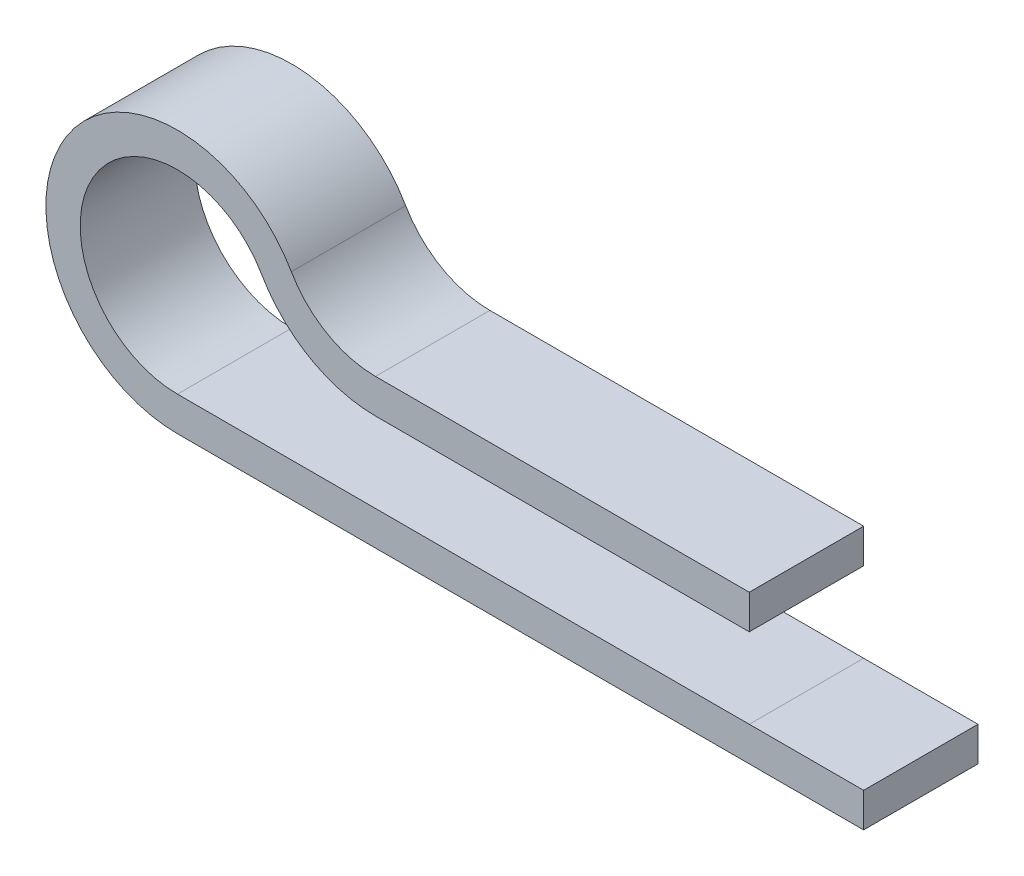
ISO-10303-21;
HEADER;
FILE_DESCRIPTION(('STEP AP214'),'2;1');
FILE_NAME('part.step','',(''),(''),'','','');
FILE_SCHEMA(('AUTOMOTIVE_DESIGN { 1 0 10303 214 1 1 1 1 }'));
ENDSEC;
DATA;
#1=APPLICATION_CONTEXT('core data for automotive mechanical design processes');
#2=APPLICATION_PROTOCOL_DEFINITION('international standard','automotive_design',2000,#1);
#3=PRODUCT_CONTEXT('',#1,'mechanical');
#4=PRODUCT('Part','Part','',(#3));
#5=PRODUCT_RELATED_PRODUCT_CATEGORY('part','',(#4));
#6=PRODUCT_DEFINITION_FORMATION('','',#4);
#7=PRODUCT_DEFINITION_CONTEXT('part definition',#1,'design');
#8=PRODUCT_DEFINITION('design','',#6,#7);
#9=PRODUCT_DEFINITION_SHAPE('','',#8);
#10=(LENGTH_UNIT() NAMED_UNIT(*) SI_UNIT(.MILLI.,.METRE.));
#11=(NAMED_UNIT(*) PLANE_ANGLE_UNIT() SI_UNIT($,.RADIAN.));
#12=(NAMED_UNIT(*) SI_UNIT($,.STERADIAN.) SOLID_ANGLE_UNIT());
#13=UNCERTAINTY_MEASURE_WITH_UNIT(LENGTH_MEASURE(1.E-05),#10,'distance_accuracy_value','');
#14=(GEOMETRIC_REPRESENTATION_CONTEXT(3) GLOBAL_UNCERTAINTY_ASSIGNED_CONTEXT((#13)) GLOBAL_UNIT_ASSIGNED_CONTEXT((#10,
#11,#12)) REPRESENTATION_CONTEXT('',''));
#15=CARTESIAN_POINT('',(0.,0.,0.));
#16=DIRECTION('',(0.,0.,1.));
#17=DIRECTION('',(1.,0.,0.));
#18=AXIS2_PLACEMENT_3D('',#15,#16,#17);
#19=CARTESIAN_POINT('',(0.,0.75,2.5));
#20=DIRECTION('',(0.,1.,0.));
#21=DIRECTION('',(0.,0.,1.));
#22=AXIS2_PLACEMENT_3D('',#19,#20,#21);
#23=PLANE('',#22);
#24=DIRECTION('',(1.,0.,0.));
#25=VECTOR('',#24,1.);
#26=CARTESIAN_POINT('',(0.,0.75,2.5));
#27=LINE('',#26,#25);
#28=CARTESIAN_POINT('',(0.,0.75,2.5));
#29=VERTEX_POINT('',#28);
#30=CARTESIAN_POINT('',(25.,0.75,2.5));
#31=VERTEX_POINT('',#30);
#32=EDGE_CURVE('E154',#29,#31,#27,.T.);
#33=ORIENTED_EDGE('',*,*,#32,.T.);
#34=DIRECTION('',(0.,0.,-1.));
#35=VECTOR('',#34,1.);
#36=CARTESIAN_POINT('',(25.,0.75,2.5));
#37=LINE('',#36,#35);
#38=CARTESIAN_POINT('',(25.,0.75,-2.5));
#39=VERTEX_POINT('',#38);
#40=EDGE_CURVE('E11',#31,#39,#37,.T.);
#41=ORIENTED_EDGE('',*,*,#40,.T.);
#42=DIRECTION('',(1.,0.,0.));
#43=VECTOR('',#42,1.);
#44=CARTESIAN_POINT('',(0.,0.75,-2.5));
#45=LINE('',#44,#43);
#46=CARTESIAN_POINT('',(0.,0.75,-2.5));
#47=VERTEX_POINT('',#46);
#48=EDGE_CURVE('E227',#47,#39,#45,.T.);
#49=ORIENTED_EDGE('',*,*,#48,.F.);
#50=DIRECTION('',(0.,0.,1.));
#51=VECTOR('',#50,1.);
#52=CARTESIAN_POINT('',(0.,0.75,2.5));
#53=LINE('',#52,#51);
#54=EDGE_CURVE('E140',#47,#29,#53,.T.);
#55=ORIENTED_EDGE('',*,*,#54,.T.);
#56=EDGE_LOOP('',(#33,#41,#49,#55));
#57=FACE_BOUND('',#56,.T.);
#58=ADVANCED_FACE('F32',(#57),#23,.T.);
#59=CARTESIAN_POINT('',(0.,-0.750000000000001,2.5));
#60=DIRECTION('',(0.,-1.,0.));
#61=DIRECTION('',(0.,0.,-1.));
#62=AXIS2_PLACEMENT_3D('',#59,#60,#61);
#63=PLANE('',#62);
#64=DIRECTION('',(1.,0.,0.));
#65=VECTOR('',#64,1.);
#66=CARTESIAN_POINT('',(0.,-0.750000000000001,-2.5));
#67=LINE('',#66,#65);
#68=CARTESIAN_POINT('',(0.,-0.750000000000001,-2.5));
#69=VERTEX_POINT('',#68);
#70=CARTESIAN_POINT('',(25.,-0.750000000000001,-2.5));
#71=VERTEX_POINT('',#70);
#72=EDGE_CURVE('E148',#69,#71,#67,.T.);
#73=ORIENTED_EDGE('',*,*,#72,.T.);
#74=DIRECTION('',(0.,0.,1.));
#75=VECTOR('',#74,1.);
#76=CARTESIAN_POINT('',(25.,-0.750000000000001,2.5));
#77=LINE('',#76,#75);
#78=CARTESIAN_POINT('',(25.,-0.750000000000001,2.5));
#79=VERTEX_POINT('',#78);
#80=EDGE_CURVE('E36',#71,#79,#77,.T.);
#81=ORIENTED_EDGE('',*,*,#80,.T.);
#82=DIRECTION('',(1.,0.,0.));
#83=VECTOR('',#82,1.);
#84=CARTESIAN_POINT('',(0.,-0.750000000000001,2.5));
#85=LINE('',#84,#83);
#86=CARTESIAN_POINT('',(0.,-0.750000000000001,2.5));
#87=VERTEX_POINT('',#86);
#88=EDGE_CURVE('E124',#87,#79,#85,.T.);
#89=ORIENTED_EDGE('',*,*,#88,.F.);
#90=DIRECTION('',(0.,0.,-1.));
#91=VECTOR('',#90,1.);
#92=CARTESIAN_POINT('',(0.,-0.750000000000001,2.5));
#93=LINE('',#92,#91);
#94=EDGE_CURVE('E134',#87,#69,#93,.T.);
#95=ORIENTED_EDGE('',*,*,#94,.T.);
#96=EDGE_LOOP('',(#73,#81,#89,#95));
#97=FACE_BOUND('',#96,.T.);
#98=ADVANCED_FACE('F143',(#97),#63,.T.);
#99=CARTESIAN_POINT('',(8.66025403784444,4.25,2.5));
#100=DIRECTION('',(0.,1.,0.));
#101=DIRECTION('',(-1.,0.,0.));
#102=AXIS2_PLACEMENT_3D('',#99,#100,#101);
#103=PLANE('',#102);
#104=DIRECTION('',(0.,0.,1.));
#105=VECTOR('',#104,1.);
#106=CARTESIAN_POINT('',(8.66025403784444,4.25,2.5));
#107=LINE('',#106,#105);
#108=CARTESIAN_POINT('',(8.66025403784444,4.25,-2.5));
#109=VERTEX_POINT('',#108);
#110=CARTESIAN_POINT('',(8.66025403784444,4.25,2.5));
#111=VERTEX_POINT('',#110);
#112=EDGE_CURVE('E167',#109,#111,#107,.T.);
#113=ORIENTED_EDGE('',*,*,#112,.F.);
#114=DIRECTION('',(1.,0.,0.));
#115=VECTOR('',#114,1.);
#116=CARTESIAN_POINT('',(8.66025403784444,4.25,-2.5));
#117=LINE('',#116,#115);
#118=CARTESIAN_POINT('',(25.0000000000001,4.25,-2.5));
#119=VERTEX_POINT('',#118);
#120=EDGE_CURVE('E194',#109,#119,#117,.T.);
#121=ORIENTED_EDGE('',*,*,#120,.T.);
#122=DIRECTION('',(0.,0.,1.));
#123=VECTOR('',#122,1.);
#124=CARTESIAN_POINT('',(25.0000000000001,4.25,2.5));
#125=LINE('',#124,#123);
#126=CARTESIAN_POINT('',(25.0000000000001,4.25,2.5));
#127=VERTEX_POINT('',#126);
#128=EDGE_CURVE('E186',#119,#127,#125,.T.);
#129=ORIENTED_EDGE('',*,*,#128,.T.);
#130=DIRECTION('',(1.,0.,0.));
#131=VECTOR('',#130,1.);
#132=CARTESIAN_POINT('',(8.66025403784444,4.25,2.5));
#133=LINE('',#132,#131);
#134=EDGE_CURVE('E197',#111,#127,#133,.T.);
#135=ORIENTED_EDGE('',*,*,#134,.F.);
#136=EDGE_LOOP('',(#113,#121,#129,#135));
#137=FACE_BOUND('',#136,.T.);
#138=ADVANCED_FACE('F34',(#137),#103,.F.);
#139=CARTESIAN_POINT('',(8.66025403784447,5.75,2.5));
#140=DIRECTION('',(0.,-1.,0.));
#141=DIRECTION('',(1.,0.,0.));
#142=AXIS2_PLACEMENT_3D('',#139,#140,#141);
#143=PLANE('',#142);
#144=DIRECTION('',(0.,0.,-1.));
#145=VECTOR('',#144,1.);
#146=CARTESIAN_POINT('',(8.66025403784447,5.75,2.5));
#147=LINE('',#146,#145);
#148=CARTESIAN_POINT('',(8.66025403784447,5.75,2.5));
#149=VERTEX_POINT('',#148);
#150=CARTESIAN_POINT('',(8.66025403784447,5.75,-2.5));
#151=VERTEX_POINT('',#150);
#152=EDGE_CURVE('E164',#149,#151,#147,.T.);
#153=ORIENTED_EDGE('',*,*,#152,.F.);
#154=DIRECTION('',(1.,0.,0.));
#155=VECTOR('',#154,1.);
#156=CARTESIAN_POINT('',(8.66025403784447,5.75,2.5));
#157=LINE('',#156,#155);
#158=CARTESIAN_POINT('',(25.0000000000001,5.75,2.5));
#159=VERTEX_POINT('',#158);
#160=EDGE_CURVE('E188',#149,#159,#157,.T.);
#161=ORIENTED_EDGE('',*,*,#160,.T.);
#162=DIRECTION('',(0.,0.,-1.));
#163=VECTOR('',#162,1.);
#164=CARTESIAN_POINT('',(25.0000000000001,5.75,2.5));
#165=LINE('',#164,#163);
#166=CARTESIAN_POINT('',(25.0000000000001,5.75,-2.5));
#167=VERTEX_POINT('',#166);
#168=EDGE_CURVE('E182',#159,#167,#165,.T.);
#169=ORIENTED_EDGE('',*,*,#168,.T.);
#170=DIRECTION('',(1.,0.,0.));
#171=VECTOR('',#170,1.);
#172=CARTESIAN_POINT('',(8.66025403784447,5.75,-2.5));
#173=LINE('',#172,#171);
#174=EDGE_CURVE('E191',#151,#167,#173,.T.);
#175=ORIENTED_EDGE('',*,*,#174,.F.);
#176=EDGE_LOOP('',(#153,#161,#169,#175));
#177=FACE_BOUND('',#176,.T.);
#178=ADVANCED_FACE('F222',(#177),#143,.F.);
#179=CARTESIAN_POINT('',(8.66025403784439,10.,0.));
#180=DIRECTION('',(0.,0.,1.));
#181=DIRECTION('',(1.,0.,0.));
#182=AXIS2_PLACEMENT_3D('',#179,#180,#181);
#183=CYLINDRICAL_SURFACE('',#182,5.75);
#184=DIRECTION('',(0.,0.,1.));
#185=VECTOR('',#184,1.);
#186=CARTESIAN_POINT('',(3.68060796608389,7.12499999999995,2.5));
#187=LINE('',#186,#185);
#188=CARTESIAN_POINT('',(3.68060796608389,7.12499999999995,-2.5));
#189=VERTEX_POINT('',#188);
#190=CARTESIAN_POINT('',(3.68060796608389,7.12499999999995,2.5));
#191=VERTEX_POINT('',#190);
#192=EDGE_CURVE('E131',#189,#191,#187,.T.);
#193=ORIENTED_EDGE('',*,*,#192,.F.);
#194=CARTESIAN_POINT('',(8.66025403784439,10.,-2.5));
#195=DIRECTION('',(0.,0.,1.));
#196=DIRECTION('',(1.,0.,0.));
#197=AXIS2_PLACEMENT_3D('',#194,#195,#196);
#198=CIRCLE('',#197,5.75);
#199=EDGE_CURVE('E174',#189,#109,#198,.T.);
#200=ORIENTED_EDGE('',*,*,#199,.T.);
#201=ORIENTED_EDGE('',*,*,#112,.T.);
#202=CARTESIAN_POINT('',(8.66025403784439,10.,2.5));
#203=DIRECTION('',(0.,0.,1.));
#204=DIRECTION('',(1.,0.,0.));
#205=AXIS2_PLACEMENT_3D('',#202,#203,#204);
#206=CIRCLE('',#205,5.75);
#207=EDGE_CURVE('E177',#191,#111,#206,.T.);
#208=ORIENTED_EDGE('',*,*,#207,.F.);
#209=EDGE_LOOP('',(#193,#200,#201,#208));
#210=FACE_BOUND('',#209,.T.);
#211=ADVANCED_FACE('F211',(#210),#183,.T.);
#212=CARTESIAN_POINT('',(8.66025403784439,10.,0.));
#213=DIRECTION('',(0.,0.,1.));
#214=DIRECTION('',(1.,0.,0.));
#215=AXIS2_PLACEMENT_3D('',#212,#213,#214);
#216=CYLINDRICAL_SURFACE('',#215,4.25);
#217=DIRECTION('',(0.,0.,-1.));
#218=VECTOR('',#217,1.);
#219=CARTESIAN_POINT('',(4.97964607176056,7.87499999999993,2.5));
#220=LINE('',#219,#218);
#221=CARTESIAN_POINT('',(4.97964607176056,7.87499999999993,2.5));
#222=VERTEX_POINT('',#221);
#223=CARTESIAN_POINT('',(4.97964607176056,7.87499999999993,-2.5));
#224=VERTEX_POINT('',#223);
#225=EDGE_CURVE('E152',#222,#224,#220,.T.);
#226=ORIENTED_EDGE('',*,*,#225,.F.);
#227=CARTESIAN_POINT('',(8.66025403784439,10.,2.5));
#228=DIRECTION('',(0.,0.,1.));
#229=DIRECTION('',(1.,0.,0.));
#230=AXIS2_PLACEMENT_3D('',#227,#228,#229);
#231=CIRCLE('',#230,4.25);
#232=EDGE_CURVE('E126',#222,#149,#231,.T.);
#233=ORIENTED_EDGE('',*,*,#232,.T.);
#234=ORIENTED_EDGE('',*,*,#152,.T.);
#235=CARTESIAN_POINT('',(8.66025403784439,10.,-2.5));
#236=DIRECTION('',(0.,0.,1.));
#237=DIRECTION('',(1.,0.,0.));
#238=AXIS2_PLACEMENT_3D('',#235,#236,#237);
#239=CIRCLE('',#238,4.25);
#240=EDGE_CURVE('E171',#224,#151,#239,.T.);
#241=ORIENTED_EDGE('',*,*,#240,.F.);
#242=EDGE_LOOP('',(#226,#233,#234,#241));
#243=FACE_BOUND('',#242,.T.);
#244=ADVANCED_FACE('F224',(#243),#216,.F.);
#245=CARTESIAN_POINT('',(0.,5.,0.));
#246=DIRECTION('',(0.,0.,-1.));
#247=DIRECTION('',(-1.,0.,0.));
#248=AXIS2_PLACEMENT_3D('',#245,#246,#247);
#249=CYLINDRICAL_SURFACE('',#248,4.25);
#250=ORIENTED_EDGE('',*,*,#54,.F.);
#251=CARTESIAN_POINT('',(0.,5.,-2.5));
#252=DIRECTION('',(0.,0.,-1.));
#253=DIRECTION('',(-1.,0.,0.));
#254=AXIS2_PLACEMENT_3D('',#251,#252,#253);
#255=CIRCLE('',#254,4.25);
#256=EDGE_CURVE('E158',#47,#189,#255,.T.);
#257=ORIENTED_EDGE('',*,*,#256,.T.);
#258=ORIENTED_EDGE('',*,*,#192,.T.);
#259=CARTESIAN_POINT('',(0.,5.,2.5));
#260=DIRECTION('',(0.,0.,-1.));
#261=DIRECTION('',(-1.,0.,0.));
#262=AXIS2_PLACEMENT_3D('',#259,#260,#261);
#263=CIRCLE('',#262,4.25);
#264=EDGE_CURVE('E161',#29,#191,#263,.T.);
#265=ORIENTED_EDGE('',*,*,#264,.F.);
#266=EDGE_LOOP('',(#250,#257,#258,#265));
#267=FACE_BOUND('',#266,.T.);
#268=ADVANCED_FACE('F245',(#267),#249,.F.);
#269=CARTESIAN_POINT('',(0.,5.,0.));
#270=DIRECTION('',(0.,0.,-1.));
#271=DIRECTION('',(-1.,0.,0.));
#272=AXIS2_PLACEMENT_3D('',#269,#270,#271);
#273=CYLINDRICAL_SURFACE('',#272,5.75);
#274=ORIENTED_EDGE('',*,*,#94,.F.);
#275=CARTESIAN_POINT('',(0.,5.,2.5));
#276=DIRECTION('',(0.,0.,-1.));
#277=DIRECTION('',(-1.,0.,0.));
#278=AXIS2_PLACEMENT_3D('',#275,#276,#277);
#279=CIRCLE('',#278,5.75);
#280=EDGE_CURVE('E119',#87,#222,#279,.T.);
#281=ORIENTED_EDGE('',*,*,#280,.T.);
#282=ORIENTED_EDGE('',*,*,#225,.T.);
#283=CARTESIAN_POINT('',(0.,5.,-2.5));
#284=DIRECTION('',(0.,0.,-1.));
#285=DIRECTION('',(-1.,0.,0.));
#286=AXIS2_PLACEMENT_3D('',#283,#284,#285);
#287=CIRCLE('',#286,5.75);
#288=EDGE_CURVE('E130',#69,#224,#287,.T.);
#289=ORIENTED_EDGE('',*,*,#288,.F.);
#290=EDGE_LOOP('',(#274,#281,#282,#289));
#291=FACE_BOUND('',#290,.T.);
#292=ADVANCED_FACE('F135',(#291),#273,.T.);
#293=CARTESIAN_POINT('',(0.,0.75,2.5));
#294=DIRECTION('',(0.,0.,1.));
#295=DIRECTION('',(0.,-1.,0.));
#296=AXIS2_PLACEMENT_3D('',#293,#294,#295);
#297=PLANE('',#296);
#298=DIRECTION('',(0.,-1.,0.));
#299=VECTOR('',#298,1.);
#300=CARTESIAN_POINT('',(30.,0.75,2.5));
#301=LINE('',#300,#299);
#302=CARTESIAN_POINT('',(30.,0.75,2.5));
#303=VERTEX_POINT('',#302);
#304=CARTESIAN_POINT('',(30.,-0.750000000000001,2.5));
#305=VERTEX_POINT('',#304);
#306=EDGE_CURVE('E239',#303,#305,#301,.T.);
#307=ORIENTED_EDGE('',*,*,#306,.F.);
#308=EDGE_CURVE('E229',#31,#303,#27,.T.);
#309=ORIENTED_EDGE('',*,*,#308,.F.);
#310=ORIENTED_EDGE('',*,*,#32,.F.);
#311=ORIENTED_EDGE('',*,*,#264,.T.);
#312=ORIENTED_EDGE('',*,*,#207,.T.);
#313=ORIENTED_EDGE('',*,*,#134,.T.);
#314=DIRECTION('',(0.,1.,0.));
#315=VECTOR('',#314,1.);
#316=CARTESIAN_POINT('',(25.0000000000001,4.25,2.5));
#317=LINE('',#316,#315);
#318=EDGE_CURVE('E180',#127,#159,#317,.T.);
#319=ORIENTED_EDGE('',*,*,#318,.T.);
#320=ORIENTED_EDGE('',*,*,#160,.F.);
#321=ORIENTED_EDGE('',*,*,#232,.F.);
#322=ORIENTED_EDGE('',*,*,#280,.F.);
#323=ORIENTED_EDGE('',*,*,#88,.T.);
#324=EDGE_CURVE('E146',#79,#305,#85,.T.);
#325=ORIENTED_EDGE('',*,*,#324,.T.);
#326=EDGE_LOOP('',(#307,#309,#310,#311,#312,#313,#319,#320,#321,#322,#323,#325));
#327=FACE_BOUND('',#326,.T.);
#328=ADVANCED_FACE('F122',(#327),#297,.T.);
#329=ORIENTED_EDGE('',*,*,#40,.F.);
#330=ORIENTED_EDGE('',*,*,#308,.T.);
#331=DIRECTION('',(0.,0.,1.));
#332=VECTOR('',#331,1.);
#333=CARTESIAN_POINT('',(30.,0.75,2.5));
#334=LINE('',#333,#332);
#335=CARTESIAN_POINT('',(30.,0.75,-2.5));
#336=VERTEX_POINT('',#335);
#337=EDGE_CURVE('E141',#336,#303,#334,.T.);
#338=ORIENTED_EDGE('',*,*,#337,.F.);
#339=EDGE_CURVE('E226',#39,#336,#45,.T.);
#340=ORIENTED_EDGE('',*,*,#339,.F.);
#341=EDGE_LOOP('',(#329,#330,#338,#340));
#342=FACE_BOUND('',#341,.T.);
#343=ADVANCED_FACE('F247',(#342),#23,.T.);
#344=CARTESIAN_POINT('',(0.,0.75,-2.5));
#345=DIRECTION('',(0.,0.,-1.));
#346=DIRECTION('',(0.,1.,0.));
#347=AXIS2_PLACEMENT_3D('',#344,#345,#346);
#348=PLANE('',#347);
#349=DIRECTION('',(0.,1.,0.));
#350=VECTOR('',#349,1.);
#351=CARTESIAN_POINT('',(30.,0.75,-2.5));
#352=LINE('',#351,#350);
#353=CARTESIAN_POINT('',(30.,-0.750000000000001,-2.5));
#354=VERTEX_POINT('',#353);
#355=EDGE_CURVE('E234',#354,#336,#352,.T.);
#356=ORIENTED_EDGE('',*,*,#355,.F.);
#357=EDGE_CURVE('E145',#71,#354,#67,.T.);
#358=ORIENTED_EDGE('',*,*,#357,.F.);
#359=ORIENTED_EDGE('',*,*,#72,.F.);
#360=ORIENTED_EDGE('',*,*,#288,.T.);
#361=ORIENTED_EDGE('',*,*,#240,.T.);
#362=ORIENTED_EDGE('',*,*,#174,.T.);
#363=DIRECTION('',(0.,-1.,0.));
#364=VECTOR('',#363,1.);
#365=CARTESIAN_POINT('',(25.0000000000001,4.25,-2.5));
#366=LINE('',#365,#364);
#367=EDGE_CURVE('E184',#167,#119,#366,.T.);
#368=ORIENTED_EDGE('',*,*,#367,.T.);
#369=ORIENTED_EDGE('',*,*,#120,.F.);
#370=ORIENTED_EDGE('',*,*,#199,.F.);
#371=ORIENTED_EDGE('',*,*,#256,.F.);
#372=ORIENTED_EDGE('',*,*,#48,.T.);
#373=ORIENTED_EDGE('',*,*,#339,.T.);
#374=EDGE_LOOP('',(#356,#358,#359,#360,#361,#362,#368,#369,#370,#371,#372,#373));
#375=FACE_BOUND('',#374,.T.);
#376=ADVANCED_FACE('F214',(#375),#348,.T.);
#377=ORIENTED_EDGE('',*,*,#80,.F.);
#378=ORIENTED_EDGE('',*,*,#357,.T.);
#379=DIRECTION('',(0.,0.,-1.));
#380=VECTOR('',#379,1.);
#381=CARTESIAN_POINT('',(30.,-0.750000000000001,2.5));
#382=LINE('',#381,#380);
#383=EDGE_CURVE('E236',#305,#354,#382,.T.);
#384=ORIENTED_EDGE('',*,*,#383,.F.);
#385=ORIENTED_EDGE('',*,*,#324,.F.);
#386=EDGE_LOOP('',(#377,#378,#384,#385));
#387=FACE_BOUND('',#386,.T.);
#388=ADVANCED_FACE('F252',(#387),#63,.T.);
#389=CARTESIAN_POINT('',(25.0000000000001,5.75,2.5));
#390=DIRECTION('',(-1.,0.,0.));
#391=DIRECTION('',(0.,0.,-1.));
#392=AXIS2_PLACEMENT_3D('',#389,#390,#391);
#393=PLANE('',#392);
#394=ORIENTED_EDGE('',*,*,#318,.F.);
#395=ORIENTED_EDGE('',*,*,#128,.F.);
#396=ORIENTED_EDGE('',*,*,#367,.F.);
#397=ORIENTED_EDGE('',*,*,#168,.F.);
#398=EDGE_LOOP('',(#394,#395,#396,#397));
#399=FACE_BOUND('',#398,.T.);
#400=ADVANCED_FACE('F219',(#399),#393,.F.);
#401=CARTESIAN_POINT('',(30.,-0.750000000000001,2.5));
#402=DIRECTION('',(1.,0.,0.));
#403=DIRECTION('',(0.,0.,-1.));
#404=AXIS2_PLACEMENT_3D('',#401,#402,#403);
#405=PLANE('',#404);
#406=ORIENTED_EDGE('',*,*,#306,.T.);
#407=ORIENTED_EDGE('',*,*,#383,.T.);
#408=ORIENTED_EDGE('',*,*,#355,.T.);
#409=ORIENTED_EDGE('',*,*,#337,.T.);
#410=EDGE_LOOP('',(#406,#407,#408,#409));
#411=FACE_BOUND('',#410,.T.);
#412=ADVANCED_FACE('F249',(#411),#405,.T.);
#413=CLOSED_SHELL('',(#58,#98,#138,#178,#211,#244,#268,#292,#328,#343,#376,#388,#400,#412));
#414=MANIFOLD_SOLID_BREP('B2',#413);
#415=ADVANCED_BREP_SHAPE_REPRESENTATION('',(#18,#414),#14);
#416=SHAPE_DEFINITION_REPRESENTATION(#9,#415);
ENDSEC;
END-ISO-10303-21;
